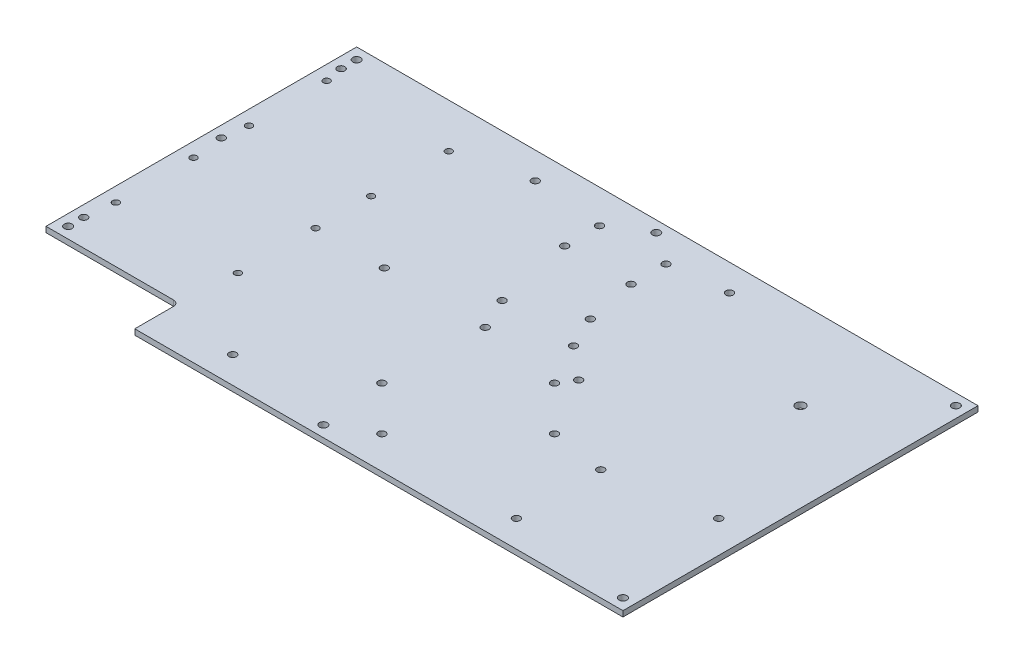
from build123d import *

# Parameters (mm, degrees)
SKETCH1_W                     = 355.6
SKETCH1_H                     = 203.2
BOSS_EXTRUDE1_DEPTH           = 3.175
F_8_CLEARANCE_HOLE1_D         = 4.4958
F_6_CLEARANCE_HOLE1_D         = 3.7973
HOLE_FOR_2_300_SC_NUTS_SP_1_D = 4.2164
HOLE_FOR_4_300_SC_NUTS_SP_1_D = 4.2164
HOLE_FOR_8_300_SC_NUTS_SP_1_D = 5.4102
CUT_EXTRUDE1_DEPTH            = 410.575


with BuildPart() as part:
    # Sketch1 → Boss-Extrude1 (new body)
    with BuildSketch(Plane(origin=(0, 0, 0), x_dir=(1, 0, 0), z_dir=(0, 1, 0))):
        with Locations((177.8, 101.6)):
            Rectangle(SKETCH1_W, SKETCH1_H)
    extrude(amount=BOSS_EXTRUDE1_DEPTH)

    # 8 Clearance Hole1 (through all)
    with Locations(Plane(origin=(0, 3.175, 0), x_dir=(1, 0, 0), z_dir=(0, 1, 0))):
        with Locations((6.35, 196.85), (177.8, 196.85), (349.25, 196.85), (349.25, 6.35), (177.8, 6.35), (6.35, 31.75)):
            Hole(F_8_CLEARANCE_HOLE1_D / 2)

    # 6 Clearance Hole1 (through all)
    with Locations(Plane(origin=(0, 0, 0), x_dir=(-1, 0, 0), z_dir=(0, -1, 0))):
        with Locations((-8.204806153, 57.168273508), (-8.204806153, 101.618273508), (-78.054806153, 101.618273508), (-78.054806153, 57.168273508), (-8.204806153, 133.368273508), (-78.054806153, 133.368273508), (-78.054806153, 177.818273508), (-8.204806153, 177.818273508)):
            Hole(F_6_CLEARANCE_HOLE1_D / 2)

    # Hole for _2 300_ SC Nuts _SP_1 (through all)
    with Locations(Plane(origin=(0, 3.175, 0), x_dir=(1, 0, 0), z_dir=(0, 1, 0))):
        with Locations((173.824558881, 43.797047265), (223.215967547, 93.188455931), (248.360684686, 68.043738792), (198.96927602, 18.652330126), (337.269144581, 73.136632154)):
            Hole(HOLE_FOR_2_300_SC_NUTS_SP_1_D / 2)

    # Hole for _4 300_ SC Nuts _SP_1 (through all)
    with Locations(Plane(origin=(0, 3.175, 0), x_dir=(1, 0, 0), z_dir=(0, 1, 0))):
        with Locations((158.144890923, 164.062811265), (158.117742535, 184.062792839), (196.117707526, 184.114374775), (196.144855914, 164.114393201), (167.302257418, 119.108761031), (175.779219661, 100.994095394), (210.197084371, 117.100323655), (201.720122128, 135.214989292), (6.35, 187.96), (6.35, 119.38), (6.35, 40.64), (117.018728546, 15.24), (117.475, 101.6), (117.475, 187.96), (228.6, 187.96), (228.6, 101.6), (279.4, 63.5), (279.4, 15.24)):
            Hole(HOLE_FOR_4_300_SC_NUTS_SP_1_D / 2)

    # Hole for _8 300_ SC Nuts _SP_1 (through all)
    with Locations(Plane(origin=(0, 3.175, 0), x_dir=(1, 0, 0), z_dir=(0, 1, 0))):
        with Locations((304.8, 152.4)):
            Hole(HOLE_FOR_8_300_SC_NUTS_SP_1_D / 2)

    # Sketch12 → Cut-Extrude1 (cut, through all)
    with BuildSketch(Plane(origin=(0, 3.175, 0), x_dir=(1, 0, 0), z_dir=(0, 1, 0))):
        with BuildLine():
            Line((-16.079964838, 25.4), (73.025, 25.4))
            ThreePointArc((73.025, 25.4), (75.27006403, 24.47006403), (76.2, 22.225))
            Line((76.2, 22.225), (76.2, -15.244107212))
            Line((76.2, -15.244107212), (-16.079964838, -15.244107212))
            Line((-16.079964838, -15.244107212), (-16.079964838, 25.4))
        make_face()
    extrude(amount=-CUT_EXTRUDE1_DEPTH, mode=Mode.SUBTRACT)


solid = part.part
